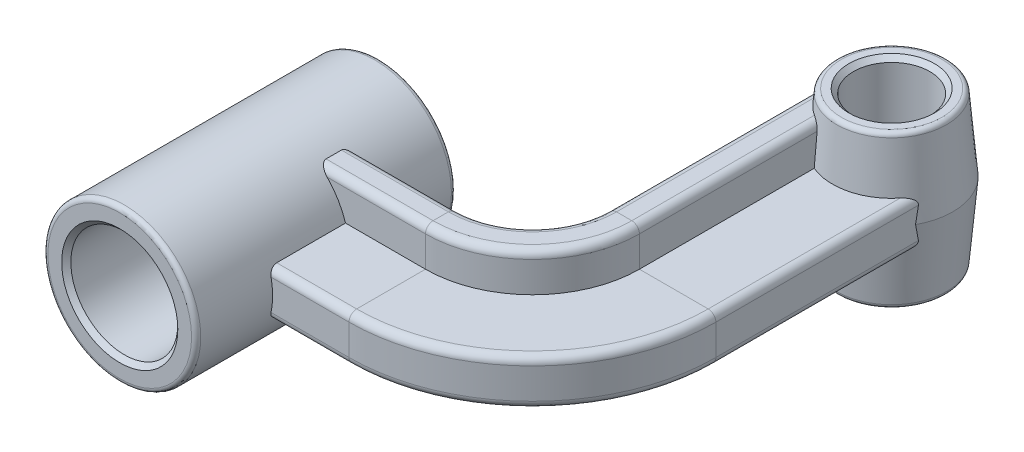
from build123d import *

# Parameters (mm, degrees)
BOSS_EXTRUDE1_DEPTH           = 120
BOSS_EXTRUDE1_DEPTH_BACK      = 50
SKETCH1_R                     = 50
SKETCH4_R                     = 40
BOSS_EXTRUDE2_DEPTH           = 50
BOSS_EXTRUDE2_TAPER           = 5
BOSS_EXTRUDE2_OTHER_WAY_DEPTH = 50
BOSS_EXTRUDE2_OTHER_WAY_TAPER = 5
SKETCH5_R                     = 35
CUT_EXTRUDE1_DEPTH            = 428.463448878
SKETCH6_R                     = 25
CUT_EXTRUDE2_DEPTH            = 344.838625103
FILLET1_R                     = 3
CHAMFER1_SIZE                 = 3


with BuildPart() as part:
    # Sketch1 → Boss-Extrude1 (new, two sides: drawn at the far end of the back side and taken through both)
    with BuildSketch(Plane.XY.offset(-BOSS_EXTRUDE1_DEPTH_BACK)):
        Circle(SKETCH1_R)
    extrude(amount=BOSS_EXTRUDE1_DEPTH + BOSS_EXTRUDE1_DEPTH_BACK)

    # Sweep1: sweep along a path in Sketch3
    with BuildLine(Plane(origin=(0, 0, 0), x_dir=(1, 0, 0), z_dir=(0, 1, 0))) as sweep1_path:
        Line((0, 0), (100, 0))
        ThreePointArc((100, 0), (135.355339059, 14.644660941), (150, 50))
        Line((150, 50), (150, 200))
    # Sketch2 → Sweep1 (sweep)
    with BuildSketch(Plane(origin=(0, 0, 0), x_dir=(0, 0, -1), z_dir=(1, 0, 0))):
        with BuildLine():
            Line((-70, 10), (-70, -10))
            ThreePointArc((-70, -10), (-68.535533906, -13.535533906), (-65, -15))
            Line((-65, -15), (-25, -15))
            ThreePointArc((-25, -15), (-21.464466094, -16.464466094), (-20, -20))
            Line((-20, -20), (-20, -35))
            ThreePointArc((-20, -35), (-18.535533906, -38.535533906), (-15, -40))
            Line((-15, -40), (-5, -40))
            ThreePointArc((-5, -40), (-1.464466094, -38.535533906), (0, -35))
            Line((0, -35), (0, 35))
            ThreePointArc((0, 35), (-1.464466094, 38.535533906), (-5, 40))
            Line((-5, 40), (-15, 40))
            ThreePointArc((-15, 40), (-18.535533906, 38.535533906), (-20, 35))
            Line((-20, 35), (-20, 15))
            Line((-20, 15), (-65, 15))
            ThreePointArc((-65, 15), (-68.535533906, 13.535533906), (-70, 10))
        make_face()
    sweep(path=sweep1_path.line)

    # Sketch4 → Boss-Extrude2 (add)
    with BuildSketch(Plane(origin=(0, 0, 0), x_dir=(1, 0, 0), z_dir=(0, 1, 0))):
        with Locations((185, 200)):
            Circle(SKETCH4_R)
    extrude(amount=BOSS_EXTRUDE2_DEPTH, taper=BOSS_EXTRUDE2_TAPER)

    # Sketch4 → Boss-Extrude2 other way (add)
    with BuildSketch(Plane(origin=(0, 0, 0), x_dir=(1, 0, 0), z_dir=(0, 1, 0))):
        with Locations((185, 200)):
            Circle(SKETCH4_R)
    extrude(amount=-BOSS_EXTRUDE2_OTHER_WAY_DEPTH, taper=BOSS_EXTRUDE2_OTHER_WAY_TAPER)

    # Sketch5 → Cut-Extrude1 (cut, through all)
    with BuildSketch(Plane.XY.offset(120)):
        Circle(SKETCH5_R)
    extrude(amount=-CUT_EXTRUDE1_DEPTH, mode=Mode.SUBTRACT)

    # Sketch6 → Cut-Extrude2 (cut, through all)
    with BuildSketch(Plane(origin=(0, 50, 0), x_dir=(1, 0, 0), z_dir=(0, 1, 0))):
        with Locations(Location((185, 200, 0), (0, 0, 270))):
            Circle(SKETCH6_R)
    extrude(amount=-CUT_EXTRUDE2_DEPTH, mode=Mode.SUBTRACT)

    # Fillet1
    fillet1_edges = [part.edges().sort_by_distance(p)[0] for p in [
        (149.374433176, -50, -200),
        (149.374433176, 50, -200),
        (-50, 0, 120),
        (-50, 0, -50),
    ]]
    fillet(fillet1_edges, radius=FILLET1_R)

    # Chamfer1
    chamfer1_edges = [part.edges().sort_by_distance(p)[0] for p in [
        (-35, 0, -50),
        (-35, 0, 120),
        (185, -50, -225),
        (185, 50, -225),
    ]]
    chamfer(chamfer1_edges, length=CHAMFER1_SIZE)


solid = part.part
